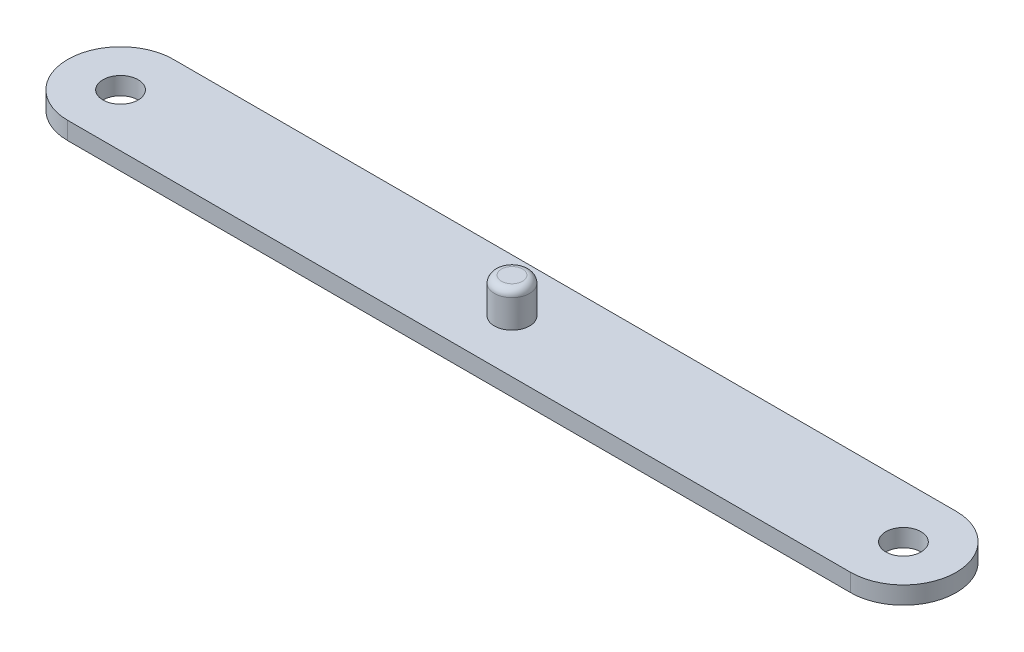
from build123d import *

# Parameters (mm, degrees)
BOSS_EXTRUDE1_DEPTH = 3.175
SKETCH2_R           = 6.35
CUT_EXTRUDE1_DEPTH  = 162.464018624
SKETCH3_R           = 6.35
BOSS_EXTRUDE2_DEPTH = 12.7
FILLET1_R           = 2.54


with BuildPart() as part:
    # Sketch1 → Boss-Extrude1 (new, symmetric)
    with BuildSketch(Plane(origin=(0, 0, 0), x_dir=(1, 0, 0), z_dir=(0, 1, 0))):
        with BuildLine():
            Line((-141.1605, -19.05), (141.1605, -19.05))
            ThreePointArc((141.1605, -19.05), (160.2105, 0), (141.1605, 19.05))
            Line((141.1605, 19.05), (-141.1605, 19.05))
            ThreePointArc((-141.1605, 19.05), (-160.2105, 0), (-141.1605, -19.05))
        make_face()
    extrude(amount=BOSS_EXTRUDE1_DEPTH, both=True)

    # Sketch2 → Cut-Extrude1 (cut, through all)
    with BuildSketch(Plane(origin=(0, 3.175, 0), x_dir=(1, 0, 0), z_dir=(0, 1, 0))):
        with Locations(Location((-141.1605, 0, 0), (0, 0, 270))):
            Circle(SKETCH2_R)
        with Locations(Location((141.1605, 0, 0), (0, 0, 90))):
            Circle(SKETCH2_R)
    extrude(amount=-CUT_EXTRUDE1_DEPTH, mode=Mode.SUBTRACT)

    # Sketch3 → Boss-Extrude2 (add)
    with BuildSketch(Plane(origin=(0, 3.175, 0), x_dir=(1, 0, 0), z_dir=(0, 1, 0))):
        with Locations(Location((0, 0, 0), (0, 0, 90))):
            Circle(SKETCH3_R)
    extrude(amount=BOSS_EXTRUDE2_DEPTH)

    # Fillet1
    fillet1_edges = [part.edges().sort_by_distance(p)[0] for p in [
        (0, 15.875, 6.35),
    ]]
    fillet(fillet1_edges, radius=FILLET1_R)


solid = part.part
